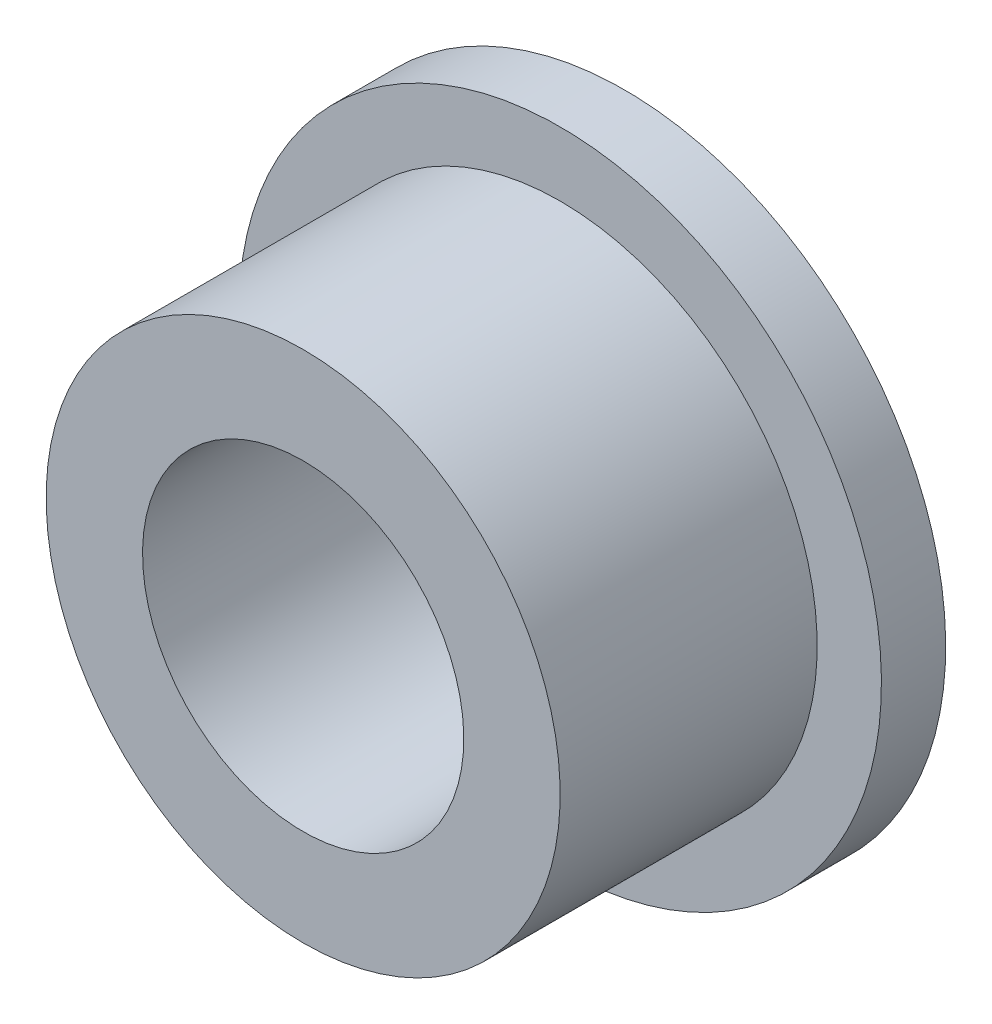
ISO-10303-21;
HEADER;
FILE_DESCRIPTION(('STEP AP214'),'2;1');
FILE_NAME('part.step','',(''),(''),'','','');
FILE_SCHEMA(('AUTOMOTIVE_DESIGN { 1 0 10303 214 1 1 1 1 }'));
ENDSEC;
DATA;
#1=APPLICATION_CONTEXT('core data for automotive mechanical design processes');
#2=APPLICATION_PROTOCOL_DEFINITION('international standard','automotive_design',2000,#1);
#3=PRODUCT_CONTEXT('',#1,'mechanical');
#4=PRODUCT('Part','Part','',(#3));
#5=PRODUCT_RELATED_PRODUCT_CATEGORY('part','',(#4));
#6=PRODUCT_DEFINITION_FORMATION('','',#4);
#7=PRODUCT_DEFINITION_CONTEXT('part definition',#1,'design');
#8=PRODUCT_DEFINITION('design','',#6,#7);
#9=PRODUCT_DEFINITION_SHAPE('','',#8);
#10=(LENGTH_UNIT() NAMED_UNIT(*) SI_UNIT(.MILLI.,.METRE.));
#11=(NAMED_UNIT(*) PLANE_ANGLE_UNIT() SI_UNIT($,.RADIAN.));
#12=(NAMED_UNIT(*) SI_UNIT($,.STERADIAN.) SOLID_ANGLE_UNIT());
#13=UNCERTAINTY_MEASURE_WITH_UNIT(LENGTH_MEASURE(1.E-05),#10,'distance_accuracy_value','');
#14=(GEOMETRIC_REPRESENTATION_CONTEXT(3) GLOBAL_UNCERTAINTY_ASSIGNED_CONTEXT((#13)) GLOBAL_UNIT_ASSIGNED_CONTEXT((#10,
#11,#12)) REPRESENTATION_CONTEXT('',''));
#15=CARTESIAN_POINT('',(0.,0.,0.));
#16=DIRECTION('',(0.,0.,1.));
#17=DIRECTION('',(1.,0.,0.));
#18=AXIS2_PLACEMENT_3D('',#15,#16,#17);
#19=CARTESIAN_POINT('',(0.,2.,2.49999999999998));
#20=DIRECTION('',(0.,0.,-0.999999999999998));
#21=DIRECTION('',(0.,0.999999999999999,0.));
#22=AXIS2_PLACEMENT_3D('',#19,#20,#21);
#23=PLANE('',#22);
#24=CARTESIAN_POINT('',(0.,0.,2.49999999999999));
#25=DIRECTION('',(0.,0.,-0.999999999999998));
#26=DIRECTION('',(0.,0.999999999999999,0.));
#27=AXIS2_PLACEMENT_3D('',#24,#25,#26);
#28=CIRCLE('',#27,1.25);
#29=CARTESIAN_POINT('',(0.,1.25000000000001,2.49999999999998));
#30=VERTEX_POINT('',#29);
#31=EDGE_CURVE('E58',#30,#30,#28,.T.);
#32=ORIENTED_EDGE('',*,*,#31,.T.);
#33=EDGE_LOOP('',(#32));
#34=FACE_BOUND('',#33,.T.);
#35=CARTESIAN_POINT('',(0.,0.,2.49999999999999));
#36=DIRECTION('',(0.,0.,0.999999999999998));
#37=DIRECTION('',(0.,-0.999999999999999,0.));
#38=AXIS2_PLACEMENT_3D('',#35,#36,#37);
#39=CIRCLE('',#38,2.);
#40=CARTESIAN_POINT('',(0.,-2.00000000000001,2.49999999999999));
#41=VERTEX_POINT('',#40);
#42=EDGE_CURVE('E46',#41,#41,#39,.T.);
#43=ORIENTED_EDGE('',*,*,#42,.T.);
#44=EDGE_LOOP('',(#43));
#45=FACE_BOUND('',#44,.T.);
#46=ADVANCED_FACE('F43',(#34,#45),#23,.F.);
#47=CARTESIAN_POINT('',(0.,0.599999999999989,0.));
#48=DIRECTION('',(0.,0.,0.999999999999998));
#49=DIRECTION('',(0.,-0.999999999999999,0.));
#50=AXIS2_PLACEMENT_3D('',#47,#48,#49);
#51=PLANE('',#50);
#52=CARTESIAN_POINT('',(0.,0.,0.));
#53=DIRECTION('',(0.,0.,-0.999999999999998));
#54=DIRECTION('',(0.,0.999999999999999,0.));
#55=AXIS2_PLACEMENT_3D('',#52,#53,#54);
#56=CIRCLE('',#55,1.25);
#57=CARTESIAN_POINT('',(0.,1.25,0.));
#58=VERTEX_POINT('',#57);
#59=EDGE_CURVE('E60',#58,#58,#56,.T.);
#60=ORIENTED_EDGE('',*,*,#59,.F.);
#61=EDGE_LOOP('',(#60));
#62=FACE_BOUND('',#61,.T.);
#63=CARTESIAN_POINT('',(0.,0.,0.));
#64=DIRECTION('',(0.,0.,0.999999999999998));
#65=DIRECTION('',(0.,-0.999999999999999,0.));
#66=AXIS2_PLACEMENT_3D('',#63,#64,#65);
#67=CIRCLE('',#66,2.5);
#68=CARTESIAN_POINT('',(0.,-2.50000000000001,0.));
#69=VERTEX_POINT('',#68);
#70=EDGE_CURVE('E12',#69,#69,#67,.T.);
#71=ORIENTED_EDGE('',*,*,#70,.F.);
#72=EDGE_LOOP('',(#71));
#73=FACE_BOUND('',#72,.T.);
#74=ADVANCED_FACE('F81',(#62,#73),#51,.F.);
#75=CARTESIAN_POINT('',(0.,0.,0.499999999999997));
#76=DIRECTION('',(0.,0.,0.999999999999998));
#77=DIRECTION('',(0.,-0.999999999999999,0.));
#78=AXIS2_PLACEMENT_3D('',#75,#76,#77);
#79=CYLINDRICAL_SURFACE('',#78,2.5);
#80=CARTESIAN_POINT('',(0.,0.,0.499999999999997));
#81=DIRECTION('',(0.,0.,0.999999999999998));
#82=DIRECTION('',(0.,-0.999999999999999,0.));
#83=AXIS2_PLACEMENT_3D('',#80,#81,#82);
#84=CIRCLE('',#83,2.5);
#85=CARTESIAN_POINT('',(0.,-2.50000000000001,0.500000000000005));
#86=VERTEX_POINT('',#85);
#87=EDGE_CURVE('E50',#86,#86,#84,.T.);
#88=CARTESIAN_POINT('',(0.,-2.50000000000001,0.500000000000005));
#89=CARTESIAN_POINT('',(0.,-2.50000000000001,0.494791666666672));
#90=CARTESIAN_POINT('',(0.,-2.50000000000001,0.489583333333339));
#91=CARTESIAN_POINT('',(0.,-2.50000000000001,0.479166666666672));
#92=CARTESIAN_POINT('',(0.,-2.50000000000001,0.473958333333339));
#93=CARTESIAN_POINT('',(0.,-2.50000000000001,0.463541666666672));
#94=CARTESIAN_POINT('',(0.,-2.50000000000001,0.458333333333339));
#95=CARTESIAN_POINT('',(0.,-2.50000000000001,0.447916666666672));
#96=CARTESIAN_POINT('',(0.,-2.50000000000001,0.442708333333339));
#97=CARTESIAN_POINT('',(0.,-2.50000000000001,0.432291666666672));
#98=CARTESIAN_POINT('',(0.,-2.50000000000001,0.427083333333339));
#99=CARTESIAN_POINT('',(0.,-2.50000000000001,0.416666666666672));
#100=CARTESIAN_POINT('',(0.,-2.50000000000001,0.411458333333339));
#101=CARTESIAN_POINT('',(0.,-2.50000000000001,0.401041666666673));
#102=CARTESIAN_POINT('',(0.,-2.50000000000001,0.395833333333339));
#103=CARTESIAN_POINT('',(0.,-2.50000000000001,0.385416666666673));
#104=CARTESIAN_POINT('',(0.,-2.50000000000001,0.380208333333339));
#105=CARTESIAN_POINT('',(0.,-2.50000000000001,0.369791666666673));
#106=CARTESIAN_POINT('',(0.,-2.50000000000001,0.364583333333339));
#107=CARTESIAN_POINT('',(0.,-2.50000000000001,0.354166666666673));
#108=CARTESIAN_POINT('',(0.,-2.50000000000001,0.34895833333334));
#109=CARTESIAN_POINT('',(0.,-2.50000000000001,0.338541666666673));
#110=CARTESIAN_POINT('',(0.,-2.50000000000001,0.33333333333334));
#111=CARTESIAN_POINT('',(0.,-2.50000000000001,0.322916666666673));
#112=CARTESIAN_POINT('',(0.,-2.50000000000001,0.31770833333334));
#113=CARTESIAN_POINT('',(0.,-2.50000000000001,0.307291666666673));
#114=CARTESIAN_POINT('',(0.,-2.50000000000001,0.30208333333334));
#115=CARTESIAN_POINT('',(0.,-2.50000000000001,0.291666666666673));
#116=CARTESIAN_POINT('',(0.,-2.50000000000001,0.28645833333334));
#117=CARTESIAN_POINT('',(0.,-2.50000000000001,0.276041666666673));
#118=CARTESIAN_POINT('',(0.,-2.50000000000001,0.27083333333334));
#119=CARTESIAN_POINT('',(0.,-2.50000000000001,0.260416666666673));
#120=CARTESIAN_POINT('',(0.,-2.50000000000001,0.25520833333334));
#121=CARTESIAN_POINT('',(0.,-2.50000000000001,0.244791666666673));
#122=CARTESIAN_POINT('',(0.,-2.50000000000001,0.23958333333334));
#123=CARTESIAN_POINT('',(0.,-2.50000000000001,0.229166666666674));
#124=CARTESIAN_POINT('',(0.,-2.50000000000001,0.22395833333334));
#125=CARTESIAN_POINT('',(0.,-2.50000000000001,0.213541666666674));
#126=CARTESIAN_POINT('',(0.,-2.50000000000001,0.20833333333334));
#127=CARTESIAN_POINT('',(0.,-2.50000000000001,0.197916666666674));
#128=CARTESIAN_POINT('',(0.,-2.50000000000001,0.19270833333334));
#129=CARTESIAN_POINT('',(0.,-2.50000000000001,0.182291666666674));
#130=CARTESIAN_POINT('',(0.,-2.50000000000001,0.177083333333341));
#131=CARTESIAN_POINT('',(0.,-2.50000000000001,0.166666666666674));
#132=CARTESIAN_POINT('',(0.,-2.50000000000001,0.161458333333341));
#133=CARTESIAN_POINT('',(0.,-2.50000000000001,0.151041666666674));
#134=CARTESIAN_POINT('',(0.,-2.50000000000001,0.145833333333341));
#135=CARTESIAN_POINT('',(0.,-2.50000000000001,0.135416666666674));
#136=CARTESIAN_POINT('',(0.,-2.50000000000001,0.130208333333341));
#137=CARTESIAN_POINT('',(0.,-2.50000000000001,0.119791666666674));
#138=CARTESIAN_POINT('',(0.,-2.50000000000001,0.114583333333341));
#139=CARTESIAN_POINT('',(0.,-2.50000000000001,0.104166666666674));
#140=CARTESIAN_POINT('',(0.,-2.50000000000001,0.098958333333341));
#141=CARTESIAN_POINT('',(0.,-2.50000000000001,0.0885416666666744));
#142=CARTESIAN_POINT('',(0.,-2.50000000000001,0.0833333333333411));
#143=CARTESIAN_POINT('',(0.,-2.50000000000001,0.0729166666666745));
#144=CARTESIAN_POINT('',(0.,-2.50000000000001,0.0677083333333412));
#145=CARTESIAN_POINT('',(0.,-2.50000000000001,0.0572916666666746));
#146=CARTESIAN_POINT('',(0.,-2.50000000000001,0.0520833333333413));
#147=CARTESIAN_POINT('',(0.,-2.50000000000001,0.0416666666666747));
#148=CARTESIAN_POINT('',(0.,-2.50000000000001,0.0364583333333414));
#149=CARTESIAN_POINT('',(0.,-2.50000000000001,0.0260416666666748));
#150=CARTESIAN_POINT('',(0.,-2.50000000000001,0.0208333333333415));
#151=CARTESIAN_POINT('',(0.,-2.50000000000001,0.0104166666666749));
#152=CARTESIAN_POINT('',(0.,-2.50000000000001,0.00520833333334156));
#153=CARTESIAN_POINT('',(0.,-2.50000000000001,0.));
#154=B_SPLINE_CURVE_WITH_KNOTS('',3,(#88,#89,#90,#91,#92,#93,#94,#95,#96,#97,#98,#99,#100,#101,
#102,#103,#104,#105,#106,#107,#108,#109,#110,#111,#112,#113,#114,#115,#116,#117,#118,#119,#120,
#121,#122,#123,#124,#125,#126,#127,#128,#129,#130,#131,#132,#133,#134,#135,#136,#137,#138,#139,
#140,#141,#142,#143,#144,#145,#146,#147,#148,#149,#150,#151,#152,#153),.UNSPECIFIED.,.F.,.F.,(4,
2,2,2,2,2,2,2,2,2,2,2,2,2,2,2,2,2,2,2,2,2,2,2,2,2,2,2,2,2,2,2,4),(0.,0.0156249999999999,
0.0312499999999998,0.0468749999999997,0.0624999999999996,0.0781249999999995,0.0937499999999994,
0.109374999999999,0.124999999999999,0.140624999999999,0.156249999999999,0.171874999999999,
0.187499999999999,0.203124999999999,0.218749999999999,0.234374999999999,0.249999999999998,
0.265624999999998,0.281249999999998,0.296874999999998,0.312499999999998,0.328124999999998,
0.343749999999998,0.359374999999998,0.374999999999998,0.390624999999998,0.406249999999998,
0.421874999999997,0.437499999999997,0.453124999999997,0.468749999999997,0.484374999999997,
0.499999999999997),.UNSPECIFIED.);
#155=EDGE_CURVE('BSEAM76',#86,#69,#154,.T.);
#156=ORIENTED_EDGE('',*,*,#87,.F.);
#157=ORIENTED_EDGE('',*,*,#70,.T.);
#158=ORIENTED_EDGE('',*,*,#155,.T.);
#159=ORIENTED_EDGE('',*,*,#155,.F.);
#160=EDGE_LOOP('',(#156,#158,#157,#159));
#161=FACE_BOUND('',#160,.T.);
#162=ADVANCED_FACE('F76',(#161),#79,.T.);
#163=CARTESIAN_POINT('',(0.,2.5,0.499999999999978));
#164=DIRECTION('',(0.,0.,-0.999999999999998));
#165=DIRECTION('',(0.,0.999999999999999,0.));
#166=AXIS2_PLACEMENT_3D('',#163,#164,#165);
#167=PLANE('',#166);
#168=CARTESIAN_POINT('',(0.,0.,0.499999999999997));
#169=DIRECTION('',(0.,0.,0.999999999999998));
#170=DIRECTION('',(0.,-0.999999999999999,0.));
#171=AXIS2_PLACEMENT_3D('',#168,#169,#170);
#172=CIRCLE('',#171,2.);
#173=CARTESIAN_POINT('',(0.,-2.00000000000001,0.500000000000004));
#174=VERTEX_POINT('',#173);
#175=EDGE_CURVE('E55',#174,#174,#172,.T.);
#176=ORIENTED_EDGE('',*,*,#175,.F.);
#177=EDGE_LOOP('',(#176));
#178=FACE_BOUND('',#177,.T.);
#179=ORIENTED_EDGE('',*,*,#87,.T.);
#180=EDGE_LOOP('',(#179));
#181=FACE_BOUND('',#180,.T.);
#182=ADVANCED_FACE('F73',(#178,#181),#167,.F.);
#183=CARTESIAN_POINT('',(0.,0.,0.499999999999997));
#184=DIRECTION('',(0.,0.,0.999999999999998));
#185=DIRECTION('',(0.,-0.999999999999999,0.));
#186=AXIS2_PLACEMENT_3D('',#183,#184,#185);
#187=CYLINDRICAL_SURFACE('',#186,2.);
#188=CARTESIAN_POINT('',(0.,-2.00000000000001,2.49999999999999));
#189=CARTESIAN_POINT('',(0.,-2.,2.47916666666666));
#190=CARTESIAN_POINT('',(0.,-2.00000000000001,2.45833333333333));
#191=CARTESIAN_POINT('',(0.,-2.00000000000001,2.41666666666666));
#192=CARTESIAN_POINT('',(0.,-2.00000000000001,2.39583333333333));
#193=CARTESIAN_POINT('',(0.,-2.00000000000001,2.35416666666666));
#194=CARTESIAN_POINT('',(0.,-2.00000000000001,2.33333333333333));
#195=CARTESIAN_POINT('',(0.,-2.00000000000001,2.29166666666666));
#196=CARTESIAN_POINT('',(0.,-2.00000000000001,2.27083333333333));
#197=CARTESIAN_POINT('',(0.,-2.00000000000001,2.22916666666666));
#198=CARTESIAN_POINT('',(0.,-2.00000000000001,2.20833333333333));
#199=CARTESIAN_POINT('',(0.,-2.00000000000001,2.16666666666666));
#200=CARTESIAN_POINT('',(0.,-2.00000000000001,2.14583333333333));
#201=CARTESIAN_POINT('',(0.,-2.00000000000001,2.10416666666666));
#202=CARTESIAN_POINT('',(0.,-2.00000000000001,2.08333333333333));
#203=CARTESIAN_POINT('',(0.,-2.00000000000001,2.04166666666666));
#204=CARTESIAN_POINT('',(0.,-2.00000000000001,2.02083333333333));
#205=CARTESIAN_POINT('',(0.,-2.00000000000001,1.97916666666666));
#206=CARTESIAN_POINT('',(0.,-2.00000000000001,1.95833333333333));
#207=CARTESIAN_POINT('',(0.,-2.00000000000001,1.91666666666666));
#208=CARTESIAN_POINT('',(0.,-2.00000000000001,1.89583333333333));
#209=CARTESIAN_POINT('',(0.,-2.00000000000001,1.85416666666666));
#210=CARTESIAN_POINT('',(0.,-2.00000000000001,1.83333333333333));
#211=CARTESIAN_POINT('',(0.,-2.00000000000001,1.79166666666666));
#212=CARTESIAN_POINT('',(0.,-2.00000000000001,1.77083333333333));
#213=CARTESIAN_POINT('',(0.,-2.00000000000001,1.72916666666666));
#214=CARTESIAN_POINT('',(0.,-2.00000000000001,1.70833333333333));
#215=CARTESIAN_POINT('',(0.,-2.00000000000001,1.66666666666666));
#216=CARTESIAN_POINT('',(0.,-2.00000000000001,1.64583333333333));
#217=CARTESIAN_POINT('',(0.,-2.00000000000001,1.60416666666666));
#218=CARTESIAN_POINT('',(0.,-2.00000000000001,1.58333333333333));
#219=CARTESIAN_POINT('',(0.,-2.00000000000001,1.54166666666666));
#220=CARTESIAN_POINT('',(0.,-2.00000000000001,1.52083333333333));
#221=CARTESIAN_POINT('',(0.,-2.00000000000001,1.47916666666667));
#222=CARTESIAN_POINT('',(0.,-2.00000000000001,1.45833333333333));
#223=CARTESIAN_POINT('',(0.,-2.00000000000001,1.41666666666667));
#224=CARTESIAN_POINT('',(0.,-2.00000000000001,1.39583333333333));
#225=CARTESIAN_POINT('',(0.,-2.00000000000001,1.35416666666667));
#226=CARTESIAN_POINT('',(0.,-2.00000000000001,1.33333333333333));
#227=CARTESIAN_POINT('',(0.,-2.00000000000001,1.29166666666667));
#228=CARTESIAN_POINT('',(0.,-2.00000000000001,1.27083333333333));
#229=CARTESIAN_POINT('',(0.,-2.00000000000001,1.22916666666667));
#230=CARTESIAN_POINT('',(0.,-2.00000000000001,1.20833333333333));
#231=CARTESIAN_POINT('',(0.,-2.00000000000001,1.16666666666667));
#232=CARTESIAN_POINT('',(0.,-2.00000000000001,1.14583333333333));
#233=CARTESIAN_POINT('',(0.,-2.00000000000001,1.10416666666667));
#234=CARTESIAN_POINT('',(0.,-2.00000000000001,1.08333333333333));
#235=CARTESIAN_POINT('',(0.,-2.00000000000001,1.04166666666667));
#236=CARTESIAN_POINT('',(0.,-2.00000000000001,1.02083333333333));
#237=CARTESIAN_POINT('',(0.,-2.00000000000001,0.979166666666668));
#238=CARTESIAN_POINT('',(0.,-2.00000000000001,0.958333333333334));
#239=CARTESIAN_POINT('',(0.,-2.00000000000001,0.916666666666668));
#240=CARTESIAN_POINT('',(0.,-2.00000000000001,0.895833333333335));
#241=CARTESIAN_POINT('',(0.,-2.00000000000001,0.854166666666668));
#242=CARTESIAN_POINT('',(0.,-2.00000000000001,0.833333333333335));
#243=CARTESIAN_POINT('',(0.,-2.00000000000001,0.791666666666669));
#244=CARTESIAN_POINT('',(0.,-2.00000000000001,0.770833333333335));
#245=CARTESIAN_POINT('',(0.,-2.00000000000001,0.729166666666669));
#246=CARTESIAN_POINT('',(0.,-2.00000000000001,0.708333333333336));
#247=CARTESIAN_POINT('',(0.,-2.00000000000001,0.666666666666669));
#248=CARTESIAN_POINT('',(0.,-2.00000000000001,0.645833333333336));
#249=CARTESIAN_POINT('',(0.,-2.00000000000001,0.60416666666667));
#250=CARTESIAN_POINT('',(0.,-2.00000000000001,0.583333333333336));
#251=CARTESIAN_POINT('',(0.,-2.00000000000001,0.54166666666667));
#252=CARTESIAN_POINT('',(0.,-2.00000000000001,0.520833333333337));
#253=CARTESIAN_POINT('',(0.,-2.00000000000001,0.500000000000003));
#254=B_SPLINE_CURVE_WITH_KNOTS('',3,(#188,#189,#190,#191,#192,#193,#194,#195,#196,#197,#198,
#199,#200,#201,#202,#203,#204,#205,#206,#207,#208,#209,#210,#211,#212,#213,#214,#215,#216,#217,
#218,#219,#220,#221,#222,#223,#224,#225,#226,#227,#228,#229,#230,#231,#232,#233,#234,#235,#236,
#237,#238,#239,#240,#241,#242,#243,#244,#245,#246,#247,#248,#249,#250,#251,#252,#253),
.UNSPECIFIED.,.F.,.F.,(4,2,2,2,2,2,2,2,2,2,2,2,2,2,2,2,2,2,2,2,2,2,2,2,2,2,2,2,2,2,2,2,4),(0.,
0.0624999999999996,0.124999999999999,0.187499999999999,0.249999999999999,0.312499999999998,
0.374999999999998,0.437499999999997,0.499999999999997,0.562499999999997,0.624999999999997,
0.687499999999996,0.749999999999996,0.812499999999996,0.874999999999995,0.937499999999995,
0.999999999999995,1.06249999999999,1.12499999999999,1.18749999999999,1.24999999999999,
1.31249999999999,1.37499999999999,1.43749999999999,1.49999999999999,1.56249999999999,
1.62499999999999,1.68749999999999,1.74999999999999,1.81249999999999,1.87499999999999,
1.93749999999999,1.99999999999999),.UNSPECIFIED.);
#255=EDGE_CURVE('BSEAM71',#41,#174,#254,.T.);
#256=ORIENTED_EDGE('',*,*,#42,.F.);
#257=ORIENTED_EDGE('',*,*,#175,.T.);
#258=ORIENTED_EDGE('',*,*,#255,.T.);
#259=ORIENTED_EDGE('',*,*,#255,.F.);
#260=EDGE_LOOP('',(#256,#258,#257,#259));
#261=FACE_BOUND('',#260,.T.);
#262=ADVANCED_FACE('F71',(#261),#187,.T.);
#263=CARTESIAN_POINT('',(0.,0.,0.));
#264=DIRECTION('',(0.,0.,-0.999999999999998));
#265=DIRECTION('',(0.,0.999999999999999,0.));
#266=AXIS2_PLACEMENT_3D('',#263,#264,#265);
#267=CYLINDRICAL_SURFACE('',#266,1.25);
#268=CARTESIAN_POINT('',(0.,1.25,0.));
#269=CARTESIAN_POINT('',(0.,1.25,0.0260416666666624));
#270=CARTESIAN_POINT('',(0.,1.25,0.0520833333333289));
#271=CARTESIAN_POINT('',(0.,1.25,0.104166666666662));
#272=CARTESIAN_POINT('',(0.,1.25,0.130208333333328));
#273=CARTESIAN_POINT('',(0.,1.25,0.182291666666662));
#274=CARTESIAN_POINT('',(0.,1.25,0.208333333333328));
#275=CARTESIAN_POINT('',(0.,1.25,0.260416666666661));
#276=CARTESIAN_POINT('',(0.,1.25,0.286458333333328));
#277=CARTESIAN_POINT('',(0.,1.25,0.338541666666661));
#278=CARTESIAN_POINT('',(0.,1.25,0.364583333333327));
#279=CARTESIAN_POINT('',(0.,1.25,0.41666666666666));
#280=CARTESIAN_POINT('',(0.,1.25,0.442708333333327));
#281=CARTESIAN_POINT('',(0.,1.25,0.49479166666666));
#282=CARTESIAN_POINT('',(0.,1.25,0.520833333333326));
#283=CARTESIAN_POINT('',(0.,1.25,0.57291666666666));
#284=CARTESIAN_POINT('',(0.,1.25,0.598958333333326));
#285=CARTESIAN_POINT('',(0.,1.25,0.651041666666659));
#286=CARTESIAN_POINT('',(0.,1.25,0.677083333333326));
#287=CARTESIAN_POINT('',(0.,1.25,0.729166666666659));
#288=CARTESIAN_POINT('',(0.,1.25,0.755208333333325));
#289=CARTESIAN_POINT('',(0.,1.25,0.807291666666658));
#290=CARTESIAN_POINT('',(0.,1.25,0.833333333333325));
#291=CARTESIAN_POINT('',(0.,1.25,0.885416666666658));
#292=CARTESIAN_POINT('',(0.,1.25,0.911458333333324));
#293=CARTESIAN_POINT('',(0.,1.25,0.963541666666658));
#294=CARTESIAN_POINT('',(0.,1.25,0.989583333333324));
#295=CARTESIAN_POINT('',(0.,1.25,1.04166666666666));
#296=CARTESIAN_POINT('',(0.,1.25,1.06770833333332));
#297=CARTESIAN_POINT('',(0.,1.25,1.11979166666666));
#298=CARTESIAN_POINT('',(0.,1.25,1.14583333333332));
#299=CARTESIAN_POINT('',(0.,1.25,1.19791666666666));
#300=CARTESIAN_POINT('',(0.,1.25,1.22395833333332));
#301=CARTESIAN_POINT('',(0.,1.25,1.27604166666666));
#302=CARTESIAN_POINT('',(0.,1.25,1.30208333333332));
#303=CARTESIAN_POINT('',(0.,1.25,1.35416666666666));
#304=CARTESIAN_POINT('',(0.,1.25,1.38020833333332));
#305=CARTESIAN_POINT('',(0.,1.25,1.43229166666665));
#306=CARTESIAN_POINT('',(0.,1.25,1.45833333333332));
#307=CARTESIAN_POINT('',(0.,1.25,1.51041666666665));
#308=CARTESIAN_POINT('',(0.,1.25,1.53645833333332));
#309=CARTESIAN_POINT('',(0.,1.25,1.58854166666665));
#310=CARTESIAN_POINT('',(0.,1.25,1.61458333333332));
#311=CARTESIAN_POINT('',(0.,1.25,1.66666666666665));
#312=CARTESIAN_POINT('',(0.,1.25,1.69270833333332));
#313=CARTESIAN_POINT('',(0.,1.25,1.74479166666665));
#314=CARTESIAN_POINT('',(0.,1.25,1.77083333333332));
#315=CARTESIAN_POINT('',(0.,1.25000000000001,1.82291666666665));
#316=CARTESIAN_POINT('',(0.,1.25000000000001,1.84895833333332));
#317=CARTESIAN_POINT('',(0.,1.25000000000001,1.90104166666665));
#318=CARTESIAN_POINT('',(0.,1.25000000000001,1.92708333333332));
#319=CARTESIAN_POINT('',(0.,1.25000000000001,1.97916666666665));
#320=CARTESIAN_POINT('',(0.,1.25000000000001,2.00520833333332));
#321=CARTESIAN_POINT('',(0.,1.25000000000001,2.05729166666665));
#322=CARTESIAN_POINT('',(0.,1.25000000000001,2.08333333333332));
#323=CARTESIAN_POINT('',(0.,1.25000000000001,2.13541666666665));
#324=CARTESIAN_POINT('',(0.,1.25000000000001,2.16145833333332));
#325=CARTESIAN_POINT('',(0.,1.25000000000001,2.21354166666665));
#326=CARTESIAN_POINT('',(0.,1.25000000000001,2.23958333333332));
#327=CARTESIAN_POINT('',(0.,1.25000000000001,2.29166666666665));
#328=CARTESIAN_POINT('',(0.,1.25000000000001,2.31770833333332));
#329=CARTESIAN_POINT('',(0.,1.25000000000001,2.36979166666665));
#330=CARTESIAN_POINT('',(0.,1.25000000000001,2.39583333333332));
#331=CARTESIAN_POINT('',(0.,1.25000000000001,2.44791666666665));
#332=CARTESIAN_POINT('',(0.,1.25000000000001,2.47395833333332));
#333=CARTESIAN_POINT('',(0.,1.25000000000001,2.49999999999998));
#334=B_SPLINE_CURVE_WITH_KNOTS('',3,(#268,#269,#270,#271,#272,#273,#274,#275,#276,#277,#278,
#279,#280,#281,#282,#283,#284,#285,#286,#287,#288,#289,#290,#291,#292,#293,#294,#295,#296,#297,
#298,#299,#300,#301,#302,#303,#304,#305,#306,#307,#308,#309,#310,#311,#312,#313,#314,#315,#316,
#317,#318,#319,#320,#321,#322,#323,#324,#325,#326,#327,#328,#329,#330,#331,#332,#333),
.UNSPECIFIED.,.F.,.F.,(4,2,2,2,2,2,2,2,2,2,2,2,2,2,2,2,2,2,2,2,2,2,2,2,2,2,2,2,2,2,2,2,4),(0.,
0.0781249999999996,0.156249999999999,0.234374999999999,0.312499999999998,0.390624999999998,
0.468749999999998,0.546874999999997,0.624999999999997,0.703124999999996,0.781249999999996,
0.859374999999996,0.937499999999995,1.01562499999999,1.09374999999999,1.17187499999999,
1.24999999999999,1.32812499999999,1.40624999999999,1.48437499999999,1.56249999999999,
1.64062499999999,1.71874999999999,1.79687499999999,1.87499999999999,1.95312499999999,
2.03124999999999,2.10937499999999,2.18749999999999,2.26562499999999,2.34374999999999,
2.42187499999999,2.49999999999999),.UNSPECIFIED.);
#335=EDGE_CURVE('BSEAM94',#58,#30,#334,.T.);
#336=ORIENTED_EDGE('',*,*,#59,.T.);
#337=ORIENTED_EDGE('',*,*,#31,.F.);
#338=ORIENTED_EDGE('',*,*,#335,.T.);
#339=ORIENTED_EDGE('',*,*,#335,.F.);
#340=EDGE_LOOP('',(#336,#338,#337,#339));
#341=FACE_BOUND('',#340,.T.);
#342=ADVANCED_FACE('F94',(#341),#267,.F.);
#343=CLOSED_SHELL('',(#46,#74,#162,#182,#262,#342));
#344=MANIFOLD_SOLID_BREP('B2',#343);
#345=ADVANCED_BREP_SHAPE_REPRESENTATION('',(#18,#344),#14);
#346=SHAPE_DEFINITION_REPRESENTATION(#9,#345);
ENDSEC;
END-ISO-10303-21;
